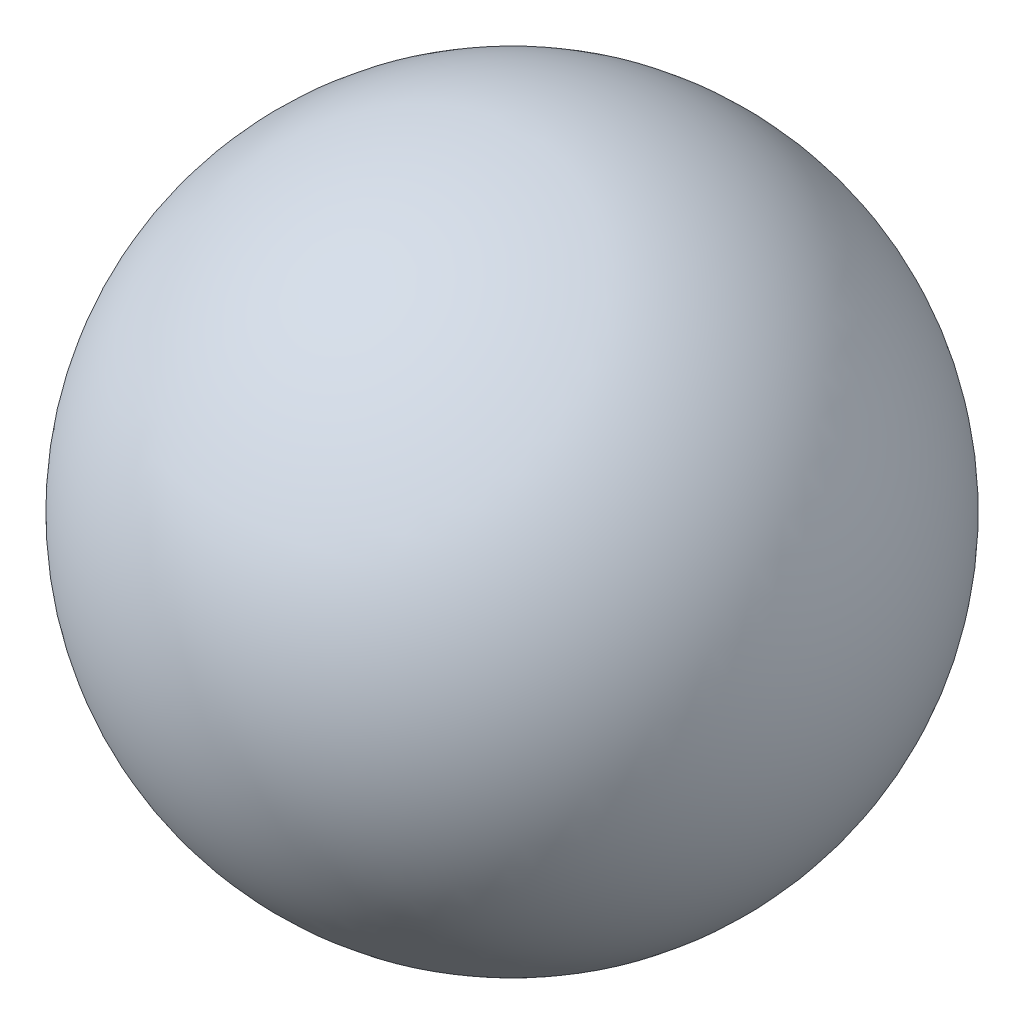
from build123d import *


with BuildPart() as part:
    # Sketch 1 → Revolve 1 (revolve)
    with BuildSketch(Plane(origin=(0, 0, 0), x_dir=(0, 0, -1), z_dir=(1, 0, 0))):
        with BuildLine():
            Line((0, 2), (0, -2))
            ThreePointArc((0, -2), (2, 0), (0, 2))
        make_face()
    revolve(axis=Axis((0, -2.940647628, 0), (0, 1, 0)))


solid = part.part
